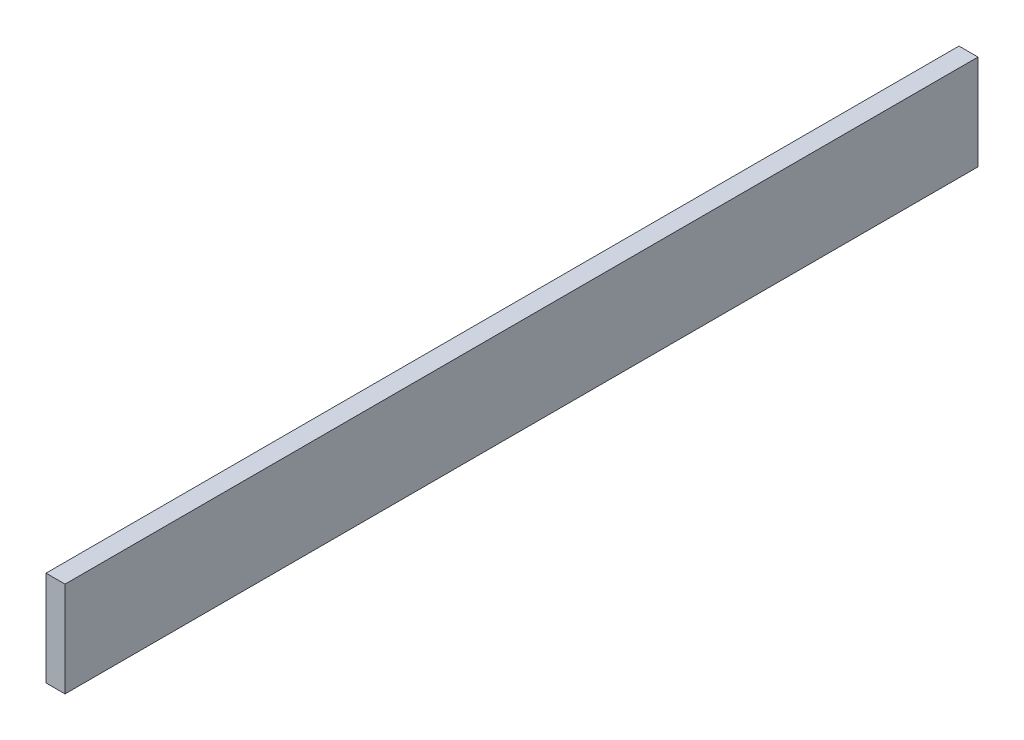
from build123d import *

# Parameters (mm, degrees)
SKIZZE1_W               = 10
SKIZZE1_H               = 50
LINEAR_AUSTRAGEN1_DEPTH = 480


with BuildPart() as part:
    # Skizze1 → Linear austragen1 (new body)
    with BuildSketch(Plane.XY):
        with Locations((5, 25)):
            Rectangle(SKIZZE1_W, SKIZZE1_H)
    extrude(amount=-LINEAR_AUSTRAGEN1_DEPTH)


solid = part.part
